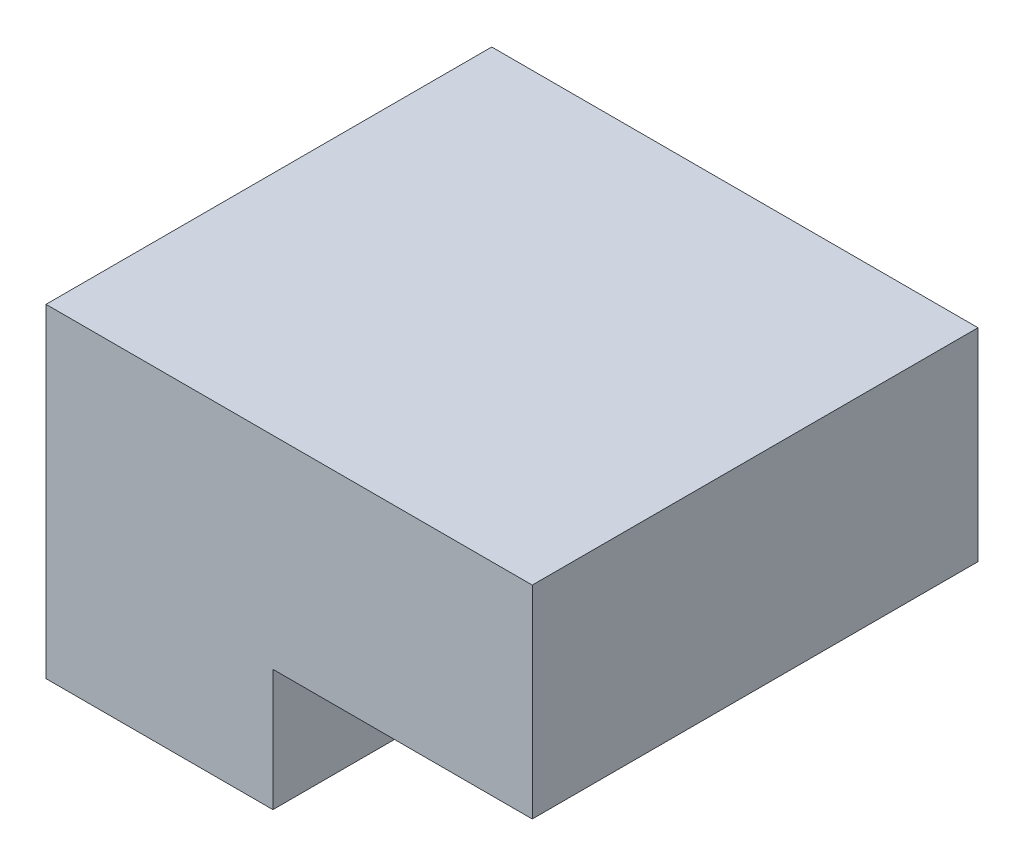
ISO-10303-21;
HEADER;
FILE_DESCRIPTION(('STEP AP214'),'2;1');
FILE_NAME('part.step','',(''),(''),'','','');
FILE_SCHEMA(('AUTOMOTIVE_DESIGN { 1 0 10303 214 1 1 1 1 }'));
ENDSEC;
DATA;
#1=APPLICATION_CONTEXT('core data for automotive mechanical design processes');
#2=APPLICATION_PROTOCOL_DEFINITION('international standard','automotive_design',2000,#1);
#3=PRODUCT_CONTEXT('',#1,'mechanical');
#4=PRODUCT('Part','Part','',(#3));
#5=PRODUCT_RELATED_PRODUCT_CATEGORY('part','',(#4));
#6=PRODUCT_DEFINITION_FORMATION('','',#4);
#7=PRODUCT_DEFINITION_CONTEXT('part definition',#1,'design');
#8=PRODUCT_DEFINITION('design','',#6,#7);
#9=PRODUCT_DEFINITION_SHAPE('','',#8);
#10=(LENGTH_UNIT() NAMED_UNIT(*) SI_UNIT(.MILLI.,.METRE.));
#11=(NAMED_UNIT(*) PLANE_ANGLE_UNIT() SI_UNIT($,.RADIAN.));
#12=(NAMED_UNIT(*) SI_UNIT($,.STERADIAN.) SOLID_ANGLE_UNIT());
#13=UNCERTAINTY_MEASURE_WITH_UNIT(LENGTH_MEASURE(1.E-05),#10,'distance_accuracy_value','');
#14=(GEOMETRIC_REPRESENTATION_CONTEXT(3) GLOBAL_UNCERTAINTY_ASSIGNED_CONTEXT((#13)) GLOBAL_UNIT_ASSIGNED_CONTEXT((#10,
#11,#12)) REPRESENTATION_CONTEXT('',''));
#15=CARTESIAN_POINT('',(0.,0.,0.));
#16=DIRECTION('',(0.,0.,1.));
#17=DIRECTION('',(1.,0.,0.));
#18=AXIS2_PLACEMENT_3D('',#15,#16,#17);
#19=CARTESIAN_POINT('',(0.,0.,55.));
#20=DIRECTION('',(-1.,0.,0.));
#21=DIRECTION('',(0.,0.,1.));
#22=AXIS2_PLACEMENT_3D('',#19,#20,#21);
#23=PLANE('',#22);
#24=DIRECTION('',(0.,0.,1.));
#25=VECTOR('',#24,1.);
#26=CARTESIAN_POINT('',(0.,15.,55.));
#27=LINE('',#26,#25);
#28=CARTESIAN_POINT('',(0.,15.,0.));
#29=VERTEX_POINT('',#28);
#30=CARTESIAN_POINT('',(0.,15.,55.));
#31=VERTEX_POINT('',#30);
#32=EDGE_CURVE('E124',#29,#31,#27,.T.);
#33=ORIENTED_EDGE('',*,*,#32,.F.);
#34=DIRECTION('',(0.,1.,0.));
#35=VECTOR('',#34,1.);
#36=CARTESIAN_POINT('',(0.,0.,0.));
#37=LINE('',#36,#35);
#38=CARTESIAN_POINT('',(0.,40.,0.));
#39=VERTEX_POINT('',#38);
#40=EDGE_CURVE('E130',#29,#39,#37,.T.);
#41=ORIENTED_EDGE('',*,*,#40,.T.);
#42=DIRECTION('',(0.,0.,-1.));
#43=VECTOR('',#42,1.);
#44=CARTESIAN_POINT('',(0.,40.,55.));
#45=LINE('',#44,#43);
#46=CARTESIAN_POINT('',(0.,40.,55.));
#47=VERTEX_POINT('',#46);
#48=EDGE_CURVE('E11',#47,#39,#45,.T.);
#49=ORIENTED_EDGE('',*,*,#48,.F.);
#50=DIRECTION('',(0.,1.,0.));
#51=VECTOR('',#50,1.);
#52=CARTESIAN_POINT('',(0.,0.,55.));
#53=LINE('',#52,#51);
#54=EDGE_CURVE('E72',#31,#47,#53,.T.);
#55=ORIENTED_EDGE('',*,*,#54,.F.);
#56=EDGE_LOOP('',(#33,#41,#49,#55));
#57=FACE_BOUND('',#56,.T.);
#58=ADVANCED_FACE('F30',(#57),#23,.F.);
#59=CARTESIAN_POINT('',(0.,40.,0.));
#60=DIRECTION('',(0.,0.,1.));
#61=DIRECTION('',(1.,0.,0.));
#62=AXIS2_PLACEMENT_3D('',#59,#60,#61);
#63=PLANE('',#62);
#64=DIRECTION('',(1.,0.,0.));
#65=VECTOR('',#64,1.);
#66=CARTESIAN_POINT('',(0.,15.,0.));
#67=LINE('',#66,#65);
#68=CARTESIAN_POINT('',(-60.,15.,0.));
#69=VERTEX_POINT('',#68);
#70=EDGE_CURVE('E122',#69,#29,#67,.T.);
#71=ORIENTED_EDGE('',*,*,#70,.F.);
#72=DIRECTION('',(0.,-1.,0.));
#73=VECTOR('',#72,1.);
#74=CARTESIAN_POINT('',(-60.,0.,0.));
#75=LINE('',#74,#73);
#76=CARTESIAN_POINT('',(-60.,40.,0.));
#77=VERTEX_POINT('',#76);
#78=EDGE_CURVE('E134',#77,#69,#75,.T.);
#79=ORIENTED_EDGE('',*,*,#78,.F.);
#80=DIRECTION('',(-1.,0.,0.));
#81=VECTOR('',#80,1.);
#82=CARTESIAN_POINT('',(0.,40.,0.));
#83=LINE('',#82,#81);
#84=EDGE_CURVE('E67',#39,#77,#83,.T.);
#85=ORIENTED_EDGE('',*,*,#84,.F.);
#86=ORIENTED_EDGE('',*,*,#40,.F.);
#87=EDGE_LOOP('',(#71,#79,#85,#86));
#88=FACE_BOUND('',#87,.T.);
#89=ADVANCED_FACE('F149',(#88),#63,.F.);
#90=CARTESIAN_POINT('',(0.,40.,55.));
#91=DIRECTION('',(0.,-1.,0.));
#92=DIRECTION('',(1.,0.,0.));
#93=AXIS2_PLACEMENT_3D('',#90,#91,#92);
#94=PLANE('',#93);
#95=ORIENTED_EDGE('',*,*,#84,.T.);
#96=DIRECTION('',(0.,0.,-1.));
#97=VECTOR('',#96,1.);
#98=CARTESIAN_POINT('',(-60.,40.,55.));
#99=LINE('',#98,#97);
#100=CARTESIAN_POINT('',(-60.,40.,55.));
#101=VERTEX_POINT('',#100);
#102=EDGE_CURVE('E37',#101,#77,#99,.T.);
#103=ORIENTED_EDGE('',*,*,#102,.F.);
#104=DIRECTION('',(-1.,0.,0.));
#105=VECTOR('',#104,1.);
#106=CARTESIAN_POINT('',(0.,40.,55.));
#107=LINE('',#106,#105);
#108=EDGE_CURVE('E133',#47,#101,#107,.T.);
#109=ORIENTED_EDGE('',*,*,#108,.F.);
#110=ORIENTED_EDGE('',*,*,#48,.T.);
#111=EDGE_LOOP('',(#95,#103,#109,#110));
#112=FACE_BOUND('',#111,.T.);
#113=ADVANCED_FACE('F154',(#112),#94,.F.);
#114=CARTESIAN_POINT('',(-60.,0.,55.));
#115=DIRECTION('',(1.,0.,0.));
#116=DIRECTION('',(0.,0.,-1.));
#117=AXIS2_PLACEMENT_3D('',#114,#115,#116);
#118=PLANE('',#117);
#119=DIRECTION('',(0.,0.,-1.));
#120=VECTOR('',#119,1.);
#121=CARTESIAN_POINT('',(-60.,15.,0.));
#122=LINE('',#121,#120);
#123=CARTESIAN_POINT('',(-60.,15.,33.));
#124=VERTEX_POINT('',#123);
#125=EDGE_CURVE('E44',#124,#69,#122,.T.);
#126=ORIENTED_EDGE('',*,*,#125,.F.);
#127=DIRECTION('',(0.,-1.,0.));
#128=VECTOR('',#127,1.);
#129=CARTESIAN_POINT('',(-60.,15.,33.));
#130=LINE('',#129,#128);
#131=CARTESIAN_POINT('',(-60.,0.,33.));
#132=VERTEX_POINT('',#131);
#133=EDGE_CURVE('E108',#124,#132,#130,.T.);
#134=ORIENTED_EDGE('',*,*,#133,.T.);
#135=DIRECTION('',(0.,0.,-1.));
#136=VECTOR('',#135,1.);
#137=CARTESIAN_POINT('',(-60.,0.,55.));
#138=LINE('',#137,#136);
#139=CARTESIAN_POINT('',(-60.,0.,55.));
#140=VERTEX_POINT('',#139);
#141=EDGE_CURVE('E139',#140,#132,#138,.T.);
#142=ORIENTED_EDGE('',*,*,#141,.F.);
#143=DIRECTION('',(0.,-1.,0.));
#144=VECTOR('',#143,1.);
#145=CARTESIAN_POINT('',(-60.,0.,55.));
#146=LINE('',#145,#144);
#147=EDGE_CURVE('E53',#101,#140,#146,.T.);
#148=ORIENTED_EDGE('',*,*,#147,.F.);
#149=ORIENTED_EDGE('',*,*,#102,.T.);
#150=ORIENTED_EDGE('',*,*,#78,.T.);
#151=EDGE_LOOP('',(#126,#134,#142,#148,#149,#150));
#152=FACE_BOUND('',#151,.T.);
#153=ADVANCED_FACE('F147',(#152),#118,.F.);
#154=CARTESIAN_POINT('',(0.,0.,55.));
#155=DIRECTION('',(0.,1.,0.));
#156=DIRECTION('',(-1.,0.,0.));
#157=AXIS2_PLACEMENT_3D('',#154,#155,#156);
#158=PLANE('',#157);
#159=DIRECTION('',(-1.,0.,0.));
#160=VECTOR('',#159,1.);
#161=CARTESIAN_POINT('',(-60.,0.,33.));
#162=LINE('',#161,#160);
#163=CARTESIAN_POINT('',(-32.,0.,33.));
#164=VERTEX_POINT('',#163);
#165=EDGE_CURVE('E117',#164,#132,#162,.T.);
#166=ORIENTED_EDGE('',*,*,#165,.F.);
#167=DIRECTION('',(0.,0.,-1.));
#168=VECTOR('',#167,1.);
#169=CARTESIAN_POINT('',(-32.,0.,55.));
#170=LINE('',#169,#168);
#171=CARTESIAN_POINT('',(-32.,0.,55.));
#172=VERTEX_POINT('',#171);
#173=EDGE_CURVE('E105',#172,#164,#170,.T.);
#174=ORIENTED_EDGE('',*,*,#173,.F.);
#175=DIRECTION('',(1.,0.,0.));
#176=VECTOR('',#175,1.);
#177=CARTESIAN_POINT('',(0.,0.,55.));
#178=LINE('',#177,#176);
#179=EDGE_CURVE('E137',#140,#172,#178,.T.);
#180=ORIENTED_EDGE('',*,*,#179,.F.);
#181=ORIENTED_EDGE('',*,*,#141,.T.);
#182=EDGE_LOOP('',(#166,#174,#180,#181));
#183=FACE_BOUND('',#182,.T.);
#184=ADVANCED_FACE('F157',(#183),#158,.F.);
#185=CARTESIAN_POINT('',(0.,40.,55.));
#186=DIRECTION('',(0.,0.,1.));
#187=DIRECTION('',(1.,0.,0.));
#188=AXIS2_PLACEMENT_3D('',#185,#186,#187);
#189=PLANE('',#188);
#190=DIRECTION('',(0.,-1.,0.));
#191=VECTOR('',#190,1.);
#192=CARTESIAN_POINT('',(-32.,15.,55.));
#193=LINE('',#192,#191);
#194=CARTESIAN_POINT('',(-32.,15.,55.));
#195=VERTEX_POINT('',#194);
#196=EDGE_CURVE('E128',#195,#172,#193,.T.);
#197=ORIENTED_EDGE('',*,*,#196,.F.);
#198=DIRECTION('',(-1.,0.,0.));
#199=VECTOR('',#198,1.);
#200=CARTESIAN_POINT('',(-32.,15.,55.));
#201=LINE('',#200,#199);
#202=EDGE_CURVE('E109',#31,#195,#201,.T.);
#203=ORIENTED_EDGE('',*,*,#202,.F.);
#204=ORIENTED_EDGE('',*,*,#54,.T.);
#205=ORIENTED_EDGE('',*,*,#108,.T.);
#206=ORIENTED_EDGE('',*,*,#147,.T.);
#207=ORIENTED_EDGE('',*,*,#179,.T.);
#208=EDGE_LOOP('',(#197,#203,#204,#205,#206,#207));
#209=FACE_BOUND('',#208,.T.);
#210=ADVANCED_FACE('F155',(#209),#189,.T.);
#211=CARTESIAN_POINT('',(-32.,15.,55.));
#212=DIRECTION('',(-1.,0.,0.));
#213=DIRECTION('',(0.,-1.,0.));
#214=AXIS2_PLACEMENT_3D('',#211,#212,#213);
#215=PLANE('',#214);
#216=ORIENTED_EDGE('',*,*,#173,.T.);
#217=DIRECTION('',(0.,-1.,0.));
#218=VECTOR('',#217,1.);
#219=CARTESIAN_POINT('',(-32.,15.,33.));
#220=LINE('',#219,#218);
#221=CARTESIAN_POINT('',(-32.,15.,33.));
#222=VERTEX_POINT('',#221);
#223=EDGE_CURVE('E98',#222,#164,#220,.T.);
#224=ORIENTED_EDGE('',*,*,#223,.F.);
#225=DIRECTION('',(0.,0.,-1.));
#226=VECTOR('',#225,1.);
#227=CARTESIAN_POINT('',(-32.,15.,55.));
#228=LINE('',#227,#226);
#229=EDGE_CURVE('E102',#195,#222,#228,.T.);
#230=ORIENTED_EDGE('',*,*,#229,.F.);
#231=ORIENTED_EDGE('',*,*,#196,.T.);
#232=EDGE_LOOP('',(#216,#224,#230,#231));
#233=FACE_BOUND('',#232,.T.);
#234=ADVANCED_FACE('F100',(#233),#215,.F.);
#235=CARTESIAN_POINT('',(-60.,15.,33.));
#236=DIRECTION('',(0.,0.,1.));
#237=DIRECTION('',(1.,0.,0.));
#238=AXIS2_PLACEMENT_3D('',#235,#236,#237);
#239=PLANE('',#238);
#240=ORIENTED_EDGE('',*,*,#165,.T.);
#241=ORIENTED_EDGE('',*,*,#133,.F.);
#242=DIRECTION('',(-1.,0.,0.));
#243=VECTOR('',#242,1.);
#244=CARTESIAN_POINT('',(-60.,15.,33.));
#245=LINE('',#244,#243);
#246=EDGE_CURVE('E111',#222,#124,#245,.T.);
#247=ORIENTED_EDGE('',*,*,#246,.F.);
#248=ORIENTED_EDGE('',*,*,#223,.T.);
#249=EDGE_LOOP('',(#240,#241,#247,#248));
#250=FACE_BOUND('',#249,.T.);
#251=ADVANCED_FACE('F112',(#250),#239,.F.);
#252=CARTESIAN_POINT('',(-32.,15.,33.));
#253=DIRECTION('',(0.,-1.,0.));
#254=DIRECTION('',(1.,0.,0.));
#255=AXIS2_PLACEMENT_3D('',#252,#253,#254);
#256=PLANE('',#255);
#257=ORIENTED_EDGE('',*,*,#229,.T.);
#258=ORIENTED_EDGE('',*,*,#246,.T.);
#259=ORIENTED_EDGE('',*,*,#125,.T.);
#260=ORIENTED_EDGE('',*,*,#70,.T.);
#261=ORIENTED_EDGE('',*,*,#32,.T.);
#262=ORIENTED_EDGE('',*,*,#202,.T.);
#263=EDGE_LOOP('',(#257,#258,#259,#260,#261,#262));
#264=FACE_BOUND('',#263,.T.);
#265=ADVANCED_FACE('F115',(#264),#256,.T.);
#266=CLOSED_SHELL('',(#58,#89,#113,#153,#184,#210,#234,#251,#265));
#267=MANIFOLD_SOLID_BREP('B2',#266);
#268=ADVANCED_BREP_SHAPE_REPRESENTATION('',(#18,#267),#14);
#269=SHAPE_DEFINITION_REPRESENTATION(#9,#268);
ENDSEC;
END-ISO-10303-21;
